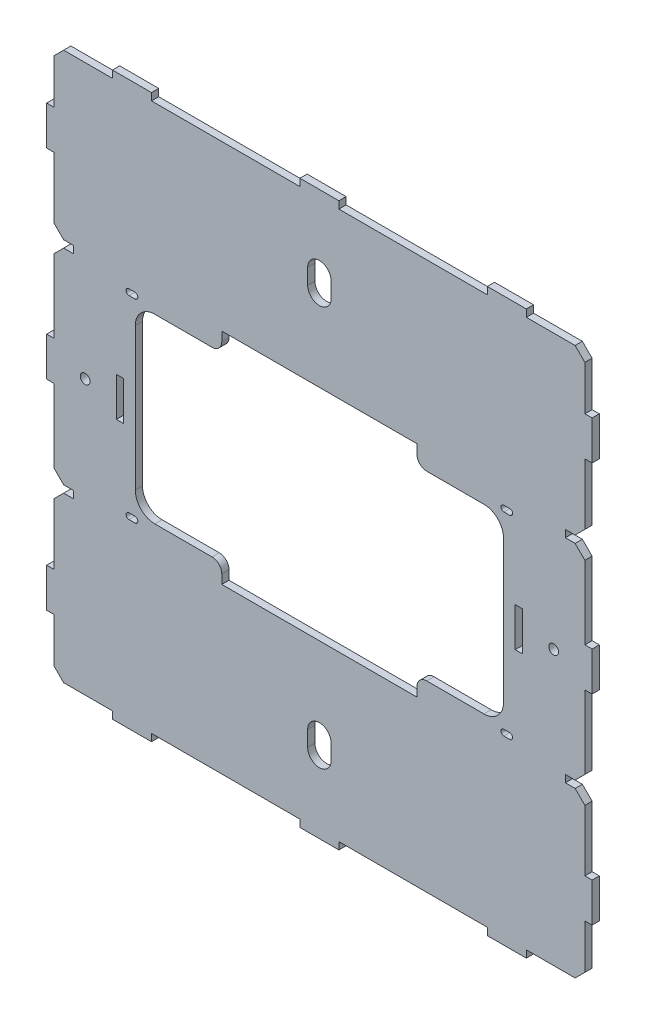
from build123d import *
from build123d.topology import SkipClean

# Parameters (mm, degrees)
BOSS_EXTRUDE1_DEPTH  = 3.7
MIRROR2_COPY_1_DEPTH = 3.7


with BuildPart() as part:
    # Sketch1 → Boss-Extrude1 (new body)
    with BuildSketch(Plane.XY):
        with BuildLine():
            Line((136, -10), (136, -32.8))
            Line((136, -32.8), (131, -37.8))
            Line((131, -37.8), (106, -37.8))
            Line((106, -37.8), (106, -41.5))
            Line((106, -41.5), (86, -41.5))
            Line((86, -41.5), (86, -37.8))
            Line((86, -37.8), (10, -37.8))
            Line((10, -37.8), (10, -41.5))
            Line((10, -41.5), (0, -41.5))
            Line((0, -41.5), (0, -10))
            ThreePointArc((0, -10), (4.242640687, -8.242640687), (6, -4))
            Line((6, -4), (6, 4))
            ThreePointArc((6, 4), (4.242640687, 8.242640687), (0, 10))
            Line((0, 10), (0, 46.3))
            Line((0, 46.3), (50, 46.3))
            Line((50, 46.3), (50, 51))
            ThreePointArc((50, 51), (51.464466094, 54.535533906), (55, 56))
            Line((55, 56), (84.3, 56))
            ThreePointArc((84.3, 56), (91.371067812, 58.928932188), (94.3, 66))
            Line((94.3, 66), (94.3, 102.5))
            Line((94.3, 102.5), (100.3, 102.5))
            Line((100.3, 102.5), (100.3, 92.5))
            Line((100.3, 92.5), (104, 92.5))
            Line((104, 92.5), (104, 102.5))
            Line((104, 102.5), (117.5, 102.5))
            ThreePointArc((117.5, 102.5), (120, 100), (122.5, 102.5))
            Line((122.5, 102.5), (139.7, 102.5))
            Line((139.7, 102.5), (139.7, 92.5))
            Line((139.7, 92.5), (136, 92.5))
            Line((136, 92.5), (136, 55))
            Line((136, 55), (131, 50))
            Line((131, 50), (126, 50))
            Line((126, 50), (126, 46.3))
            Line((126, 46.3), (131, 46.3))
            Line((131, 46.3), (136, 41.3))
            Line((136, 41.3), (136, 10))
            Line((136, 10), (139.7, 10))
            Line((139.7, 10), (139.7, -10))
            Line((139.7, -10), (136, -10))
        make_face()
        with BuildLine():
            Line((94.5, 54.3), (97.5, 54.3))
            ThreePointArc((97.5, 54.3), (99, 52.8), (97.5, 51.3))
            Line((97.5, 51.3), (94.5, 51.3))
            ThreePointArc((94.5, 51.3), (93, 52.8), (94.5, 54.3))
        make_face(mode=Mode.SUBTRACT)
    boss_extrude1 = extrude(amount=BOSS_EXTRUDE1_DEPTH)

    # Mirror1: Boss-Extrude1 across plane
    add(boss_extrude1.mirror(Plane(origin=(0, 0, 0), x_dir=(0, 0, 1), z_dir=(1, 0, 0))))

    # Mirror2: Boss-Extrude1 across plane
    add(boss_extrude1.mirror(Plane(origin=(94.3, 102.5, 3.7), x_dir=(0, 0, 1), z_dir=(0, -1, 0))))

    # Mirror2 copy 1 sketch → Mirror2 copy 1 (add)
    with SkipClean():  # the faces are left unmerged after this step: merging them gives an invalid solid
        with BuildSketch(Plane(origin=(0, 205, 0), x_dir=(-1, 0, 0), z_dir=(0, 0, 1))):
            with BuildLine():
                Line((136, -10), (136, -32.8))
                Line((136, -32.8), (131, -37.8))
                Line((131, -37.8), (106, -37.8))
                Line((106, -37.8), (106, -41.5))
                Line((106, -41.5), (86, -41.5))
                Line((86, -41.5), (86, -37.8))
                Line((86, -37.8), (10, -37.8))
                Line((10, -37.8), (10, -41.5))
                Line((10, -41.5), (0, -41.5))
                Line((0, -41.5), (0, -10))
                ThreePointArc((0, -10), (4.242640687, -8.242640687), (6, -4))
                Line((6, -4), (6, 4))
                ThreePointArc((6, 4), (4.242640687, 8.242640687), (0, 10))
                Line((0, 10), (0, 46.3))
                Line((0, 46.3), (50, 46.3))
                Line((50, 46.3), (50, 51))
                ThreePointArc((50, 51), (51.464466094, 54.535533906), (55, 56))
                Line((55, 56), (84.3, 56))
                ThreePointArc((84.3, 56), (91.371067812, 58.928932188), (94.3, 66))
                Line((94.3, 66), (94.3, 102.5))
                Line((94.3, 102.5), (100.3, 102.5))
                Line((100.3, 102.5), (100.3, 92.5))
                Line((100.3, 92.5), (104, 92.5))
                Line((104, 92.5), (104, 102.5))
                Line((104, 102.5), (117.5, 102.5))
                ThreePointArc((117.5, 102.5), (120, 100), (122.5, 102.5))
                Line((122.5, 102.5), (139.7, 102.5))
                Line((139.7, 102.5), (139.7, 92.5))
                Line((139.7, 92.5), (136, 92.5))
                Line((136, 92.5), (136, 55))
                Line((136, 55), (131, 50))
                Line((131, 50), (126, 50))
                Line((126, 50), (126, 46.3))
                Line((126, 46.3), (131, 46.3))
                Line((131, 46.3), (136, 41.3))
                Line((136, 41.3), (136, 10))
                Line((136, 10), (139.7, 10))
                Line((139.7, 10), (139.7, -10))
                Line((139.7, -10), (136, -10))
            make_face()
            with BuildLine():
                Line((94.5, 54.3), (97.5, 54.3))
                ThreePointArc((97.5, 54.3), (99, 52.8), (97.5, 51.3))
                Line((97.5, 51.3), (94.5, 51.3))
                ThreePointArc((94.5, 51.3), (93, 52.8), (94.5, 54.3))
            make_face(mode=Mode.SUBTRACT)
        extrude(amount=MIRROR2_COPY_1_DEPTH)


solid = part.part
